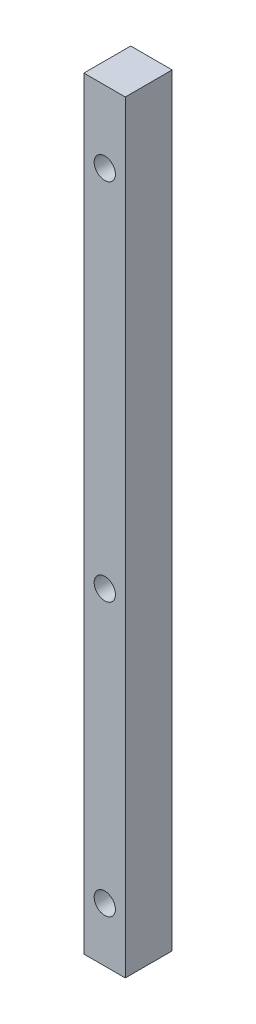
ISO-10303-21;
HEADER;
FILE_DESCRIPTION(('STEP AP214'),'2;1');
FILE_NAME('part.step','',(''),(''),'','','');
FILE_SCHEMA(('AUTOMOTIVE_DESIGN { 1 0 10303 214 1 1 1 1 }'));
ENDSEC;
DATA;
#1=APPLICATION_CONTEXT('core data for automotive mechanical design processes');
#2=APPLICATION_PROTOCOL_DEFINITION('international standard','automotive_design',2000,#1);
#3=PRODUCT_CONTEXT('',#1,'mechanical');
#4=PRODUCT('Part','Part','',(#3));
#5=PRODUCT_RELATED_PRODUCT_CATEGORY('part','',(#4));
#6=PRODUCT_DEFINITION_FORMATION('','',#4);
#7=PRODUCT_DEFINITION_CONTEXT('part definition',#1,'design');
#8=PRODUCT_DEFINITION('design','',#6,#7);
#9=PRODUCT_DEFINITION_SHAPE('','',#8);
#10=(LENGTH_UNIT() NAMED_UNIT(*) SI_UNIT(.MILLI.,.METRE.));
#11=(NAMED_UNIT(*) PLANE_ANGLE_UNIT() SI_UNIT($,.RADIAN.));
#12=(NAMED_UNIT(*) SI_UNIT($,.STERADIAN.) SOLID_ANGLE_UNIT());
#13=UNCERTAINTY_MEASURE_WITH_UNIT(LENGTH_MEASURE(1.E-05),#10,'distance_accuracy_value','');
#14=(GEOMETRIC_REPRESENTATION_CONTEXT(3) GLOBAL_UNCERTAINTY_ASSIGNED_CONTEXT((#13)) GLOBAL_UNIT_ASSIGNED_CONTEXT((#10,
#11,#12)) REPRESENTATION_CONTEXT('',''));
#15=CARTESIAN_POINT('',(0.,0.,0.));
#16=DIRECTION('',(0.,0.,1.));
#17=DIRECTION('',(1.,0.,0.));
#18=AXIS2_PLACEMENT_3D('',#15,#16,#17);
#19=CARTESIAN_POINT('',(0.,0.,10.922));
#20=DIRECTION('',(0.,0.,1.));
#21=DIRECTION('',(1.,0.,0.));
#22=AXIS2_PLACEMENT_3D('',#19,#20,#21);
#23=PLANE('',#22);
#24=CARTESIAN_POINT('',(4.87680000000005,-165.1,10.922));
#25=DIRECTION('',(0.,0.,1.));
#26=DIRECTION('',(1.,0.,0.));
#27=AXIS2_PLACEMENT_3D('',#24,#25,#26);
#28=CIRCLE('',#27,2.47650000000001);
#29=CARTESIAN_POINT('',(7.35330000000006,-165.1,10.922));
#30=VERTEX_POINT('',#29);
#31=EDGE_CURVE('E115',#30,#30,#28,.T.);
#32=ORIENTED_EDGE('',*,*,#31,.F.);
#33=EDGE_LOOP('',(#32));
#34=FACE_BOUND('',#33,.T.);
#35=DIRECTION('',(0.,-1.,0.));
#36=VECTOR('',#35,1.);
#37=CARTESIAN_POINT('',(0.,0.,10.922));
#38=LINE('',#37,#36);
#39=CARTESIAN_POINT('',(0.,0.,10.922));
#40=VERTEX_POINT('',#39);
#41=CARTESIAN_POINT('',(0.,-177.8,10.922));
#42=VERTEX_POINT('',#41);
#43=EDGE_CURVE('E85',#40,#42,#38,.T.);
#44=ORIENTED_EDGE('',*,*,#43,.T.);
#45=DIRECTION('',(1.,0.,0.));
#46=VECTOR('',#45,1.);
#47=CARTESIAN_POINT('',(0.,-177.8,10.922));
#48=LINE('',#47,#46);
#49=CARTESIAN_POINT('',(9.65200000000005,-177.8,10.922));
#50=VERTEX_POINT('',#49);
#51=EDGE_CURVE('E80',#42,#50,#48,.T.);
#52=ORIENTED_EDGE('',*,*,#51,.T.);
#53=DIRECTION('',(0.,1.,0.));
#54=VECTOR('',#53,1.);
#55=CARTESIAN_POINT('',(9.652,0.,10.922));
#56=LINE('',#55,#54);
#57=CARTESIAN_POINT('',(9.652,0.,10.922));
#58=VERTEX_POINT('',#57);
#59=EDGE_CURVE('E83',#50,#58,#56,.T.);
#60=ORIENTED_EDGE('',*,*,#59,.T.);
#61=DIRECTION('',(-1.,0.,0.));
#62=VECTOR('',#61,1.);
#63=CARTESIAN_POINT('',(0.,0.,10.922));
#64=LINE('',#63,#62);
#65=EDGE_CURVE('E50',#58,#40,#64,.T.);
#66=ORIENTED_EDGE('',*,*,#65,.T.);
#67=EDGE_LOOP('',(#44,#52,#60,#66));
#68=FACE_BOUND('',#67,.T.);
#69=CARTESIAN_POINT('',(4.87680000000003,-101.6,10.922));
#70=DIRECTION('',(0.,0.,1.));
#71=DIRECTION('',(1.,0.,0.));
#72=AXIS2_PLACEMENT_3D('',#69,#70,#71);
#73=CIRCLE('',#72,2.4765);
#74=CARTESIAN_POINT('',(7.35330000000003,-101.6,10.922));
#75=VERTEX_POINT('',#74);
#76=EDGE_CURVE('E100',#75,#75,#73,.T.);
#77=ORIENTED_EDGE('',*,*,#76,.F.);
#78=EDGE_LOOP('',(#77));
#79=FACE_BOUND('',#78,.T.);
#80=CARTESIAN_POINT('',(4.8768,-16.764,10.922));
#81=DIRECTION('',(0.,0.,1.));
#82=DIRECTION('',(1.,0.,0.));
#83=AXIS2_PLACEMENT_3D('',#80,#81,#82);
#84=CIRCLE('',#83,2.4765);
#85=CARTESIAN_POINT('',(7.3533,-16.764,10.922));
#86=VERTEX_POINT('',#85);
#87=EDGE_CURVE('E121',#86,#86,#84,.T.);
#88=ORIENTED_EDGE('',*,*,#87,.F.);
#89=EDGE_LOOP('',(#88));
#90=FACE_BOUND('',#89,.T.);
#91=ADVANCED_FACE('F33',(#34,#68,#79,#90),#23,.T.);
#92=CARTESIAN_POINT('',(0.,0.,0.));
#93=DIRECTION('',(0.,0.,1.));
#94=DIRECTION('',(1.,0.,0.));
#95=AXIS2_PLACEMENT_3D('',#92,#93,#94);
#96=PLANE('',#95);
#97=DIRECTION('',(0.,-1.,0.));
#98=VECTOR('',#97,1.);
#99=CARTESIAN_POINT('',(0.,0.,0.));
#100=LINE('',#99,#98);
#101=CARTESIAN_POINT('',(0.,0.,0.));
#102=VERTEX_POINT('',#101);
#103=CARTESIAN_POINT('',(0.,-177.8,0.));
#104=VERTEX_POINT('',#103);
#105=EDGE_CURVE('E97',#102,#104,#100,.T.);
#106=ORIENTED_EDGE('',*,*,#105,.F.);
#107=DIRECTION('',(-1.,0.,0.));
#108=VECTOR('',#107,1.);
#109=CARTESIAN_POINT('',(0.,0.,0.));
#110=LINE('',#109,#108);
#111=CARTESIAN_POINT('',(9.652,0.,0.));
#112=VERTEX_POINT('',#111);
#113=EDGE_CURVE('E73',#112,#102,#110,.T.);
#114=ORIENTED_EDGE('',*,*,#113,.F.);
#115=DIRECTION('',(0.,1.,0.));
#116=VECTOR('',#115,1.);
#117=CARTESIAN_POINT('',(9.652,0.,0.));
#118=LINE('',#117,#116);
#119=CARTESIAN_POINT('',(9.65200000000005,-177.8,0.));
#120=VERTEX_POINT('',#119);
#121=EDGE_CURVE('E67',#120,#112,#118,.T.);
#122=ORIENTED_EDGE('',*,*,#121,.F.);
#123=DIRECTION('',(1.,0.,0.));
#124=VECTOR('',#123,1.);
#125=CARTESIAN_POINT('',(0.,-177.8,0.));
#126=LINE('',#125,#124);
#127=EDGE_CURVE('E89',#104,#120,#126,.T.);
#128=ORIENTED_EDGE('',*,*,#127,.F.);
#129=EDGE_LOOP('',(#106,#114,#122,#128));
#130=FACE_BOUND('',#129,.T.);
#131=CARTESIAN_POINT('',(4.87680000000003,-101.6,0.));
#132=DIRECTION('',(0.,0.,1.));
#133=DIRECTION('',(1.,0.,0.));
#134=AXIS2_PLACEMENT_3D('',#131,#132,#133);
#135=CIRCLE('',#134,2.4765);
#136=CARTESIAN_POINT('',(7.35330000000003,-101.6,0.));
#137=VERTEX_POINT('',#136);
#138=EDGE_CURVE('E112',#137,#137,#135,.T.);
#139=ORIENTED_EDGE('',*,*,#138,.T.);
#140=EDGE_LOOP('',(#139));
#141=FACE_BOUND('',#140,.T.);
#142=CARTESIAN_POINT('',(4.87680000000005,-165.1,0.));
#143=DIRECTION('',(0.,0.,1.));
#144=DIRECTION('',(1.,0.,0.));
#145=AXIS2_PLACEMENT_3D('',#142,#143,#144);
#146=CIRCLE('',#145,2.47650000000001);
#147=CARTESIAN_POINT('',(7.35330000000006,-165.1,0.));
#148=VERTEX_POINT('',#147);
#149=EDGE_CURVE('E118',#148,#148,#146,.T.);
#150=ORIENTED_EDGE('',*,*,#149,.T.);
#151=EDGE_LOOP('',(#150));
#152=FACE_BOUND('',#151,.T.);
#153=CARTESIAN_POINT('',(4.8768,-16.764,0.));
#154=DIRECTION('',(0.,0.,1.));
#155=DIRECTION('',(1.,0.,0.));
#156=AXIS2_PLACEMENT_3D('',#153,#154,#155);
#157=CIRCLE('',#156,2.4765);
#158=CARTESIAN_POINT('',(7.3533,-16.764,0.));
#159=VERTEX_POINT('',#158);
#160=EDGE_CURVE('E124',#159,#159,#157,.T.);
#161=ORIENTED_EDGE('',*,*,#160,.T.);
#162=EDGE_LOOP('',(#161));
#163=FACE_BOUND('',#162,.T.);
#164=ADVANCED_FACE('F108',(#130,#141,#152,#163),#96,.F.);
#165=CARTESIAN_POINT('',(0.,0.,10.922));
#166=DIRECTION('',(1.,0.,0.));
#167=DIRECTION('',(0.,1.,0.));
#168=AXIS2_PLACEMENT_3D('',#165,#166,#167);
#169=PLANE('',#168);
#170=ORIENTED_EDGE('',*,*,#105,.T.);
#171=DIRECTION('',(0.,0.,-1.));
#172=VECTOR('',#171,1.);
#173=CARTESIAN_POINT('',(0.,-177.8,10.922));
#174=LINE('',#173,#172);
#175=EDGE_CURVE('E11',#42,#104,#174,.T.);
#176=ORIENTED_EDGE('',*,*,#175,.F.);
#177=ORIENTED_EDGE('',*,*,#43,.F.);
#178=DIRECTION('',(0.,0.,-1.));
#179=VECTOR('',#178,1.);
#180=CARTESIAN_POINT('',(0.,0.,10.922));
#181=LINE('',#180,#179);
#182=EDGE_CURVE('E93',#40,#102,#181,.T.);
#183=ORIENTED_EDGE('',*,*,#182,.T.);
#184=EDGE_LOOP('',(#170,#176,#177,#183));
#185=FACE_BOUND('',#184,.T.);
#186=ADVANCED_FACE('F35',(#185),#169,.F.);
#187=CARTESIAN_POINT('',(0.,-177.8,10.922));
#188=DIRECTION('',(0.,1.,0.));
#189=DIRECTION('',(0.,0.,1.));
#190=AXIS2_PLACEMENT_3D('',#187,#188,#189);
#191=PLANE('',#190);
#192=ORIENTED_EDGE('',*,*,#127,.T.);
#193=DIRECTION('',(0.,0.,-1.));
#194=VECTOR('',#193,1.);
#195=CARTESIAN_POINT('',(9.65200000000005,-177.8,10.922));
#196=LINE('',#195,#194);
#197=EDGE_CURVE('E42',#50,#120,#196,.T.);
#198=ORIENTED_EDGE('',*,*,#197,.F.);
#199=ORIENTED_EDGE('',*,*,#51,.F.);
#200=ORIENTED_EDGE('',*,*,#175,.T.);
#201=EDGE_LOOP('',(#192,#198,#199,#200));
#202=FACE_BOUND('',#201,.T.);
#203=ADVANCED_FACE('F88',(#202),#191,.F.);
#204=CARTESIAN_POINT('',(9.652,0.,10.922));
#205=DIRECTION('',(-1.,0.,0.));
#206=DIRECTION('',(0.,-1.,0.));
#207=AXIS2_PLACEMENT_3D('',#204,#205,#206);
#208=PLANE('',#207);
#209=ORIENTED_EDGE('',*,*,#121,.T.);
#210=DIRECTION('',(0.,0.,-1.));
#211=VECTOR('',#210,1.);
#212=CARTESIAN_POINT('',(9.652,0.,10.922));
#213=LINE('',#212,#211);
#214=EDGE_CURVE('E90',#58,#112,#213,.T.);
#215=ORIENTED_EDGE('',*,*,#214,.F.);
#216=ORIENTED_EDGE('',*,*,#59,.F.);
#217=ORIENTED_EDGE('',*,*,#197,.T.);
#218=EDGE_LOOP('',(#209,#215,#216,#217));
#219=FACE_BOUND('',#218,.T.);
#220=ADVANCED_FACE('F91',(#219),#208,.F.);
#221=CARTESIAN_POINT('',(0.,0.,10.922));
#222=DIRECTION('',(0.,-1.,0.));
#223=DIRECTION('',(0.,0.,-1.));
#224=AXIS2_PLACEMENT_3D('',#221,#222,#223);
#225=PLANE('',#224);
#226=ORIENTED_EDGE('',*,*,#113,.T.);
#227=ORIENTED_EDGE('',*,*,#182,.F.);
#228=ORIENTED_EDGE('',*,*,#65,.F.);
#229=ORIENTED_EDGE('',*,*,#214,.T.);
#230=EDGE_LOOP('',(#226,#227,#228,#229));
#231=FACE_BOUND('',#230,.T.);
#232=ADVANCED_FACE('F105',(#231),#225,.F.);
#233=CARTESIAN_POINT('',(4.87680000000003,-101.6,10.922));
#234=DIRECTION('',(0.,0.,-1.));
#235=DIRECTION('',(-1.,0.,0.));
#236=AXIS2_PLACEMENT_3D('',#233,#234,#235);
#237=CYLINDRICAL_SURFACE('',#236,2.4765);
#238=ORIENTED_EDGE('',*,*,#76,.T.);
#239=EDGE_LOOP('',(#238));
#240=FACE_BOUND('',#239,.T.);
#241=ORIENTED_EDGE('',*,*,#138,.F.);
#242=EDGE_LOOP('',(#241));
#243=FACE_BOUND('',#242,.T.);
#244=ADVANCED_FACE('F142',(#240,#243),#237,.F.);
#245=CARTESIAN_POINT('',(4.87680000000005,-165.1,10.922));
#246=DIRECTION('',(0.,0.,-1.));
#247=DIRECTION('',(-1.,0.,0.));
#248=AXIS2_PLACEMENT_3D('',#245,#246,#247);
#249=CYLINDRICAL_SURFACE('',#248,2.47650000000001);
#250=ORIENTED_EDGE('',*,*,#31,.T.);
#251=EDGE_LOOP('',(#250));
#252=FACE_BOUND('',#251,.T.);
#253=ORIENTED_EDGE('',*,*,#149,.F.);
#254=EDGE_LOOP('',(#253));
#255=FACE_BOUND('',#254,.T.);
#256=ADVANCED_FACE('F188',(#252,#255),#249,.F.);
#257=CARTESIAN_POINT('',(4.8768,-16.764,10.922));
#258=DIRECTION('',(0.,0.,-1.));
#259=DIRECTION('',(-1.,0.,0.));
#260=AXIS2_PLACEMENT_3D('',#257,#258,#259);
#261=CYLINDRICAL_SURFACE('',#260,2.4765);
#262=ORIENTED_EDGE('',*,*,#87,.T.);
#263=EDGE_LOOP('',(#262));
#264=FACE_BOUND('',#263,.T.);
#265=ORIENTED_EDGE('',*,*,#160,.F.);
#266=EDGE_LOOP('',(#265));
#267=FACE_BOUND('',#266,.T.);
#268=ADVANCED_FACE('F130',(#264,#267),#261,.F.);
#269=CLOSED_SHELL('',(#91,#164,#186,#203,#220,#232,#244,#256,#268));
#270=MANIFOLD_SOLID_BREP('B2',#269);
#271=ADVANCED_BREP_SHAPE_REPRESENTATION('',(#18,#270),#14);
#272=SHAPE_DEFINITION_REPRESENTATION(#9,#271);
ENDSEC;
END-ISO-10303-21;
